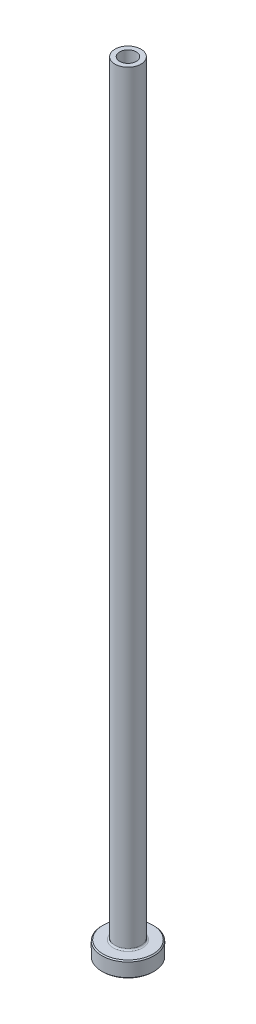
from build123d import *

# Parameters (mm, degrees)
FILLET1_R     = 0.3
CHAMFER1_SIZE = 0.2
CHAMFER3_SIZE = 0.5


with BuildPart() as part:
    # Sketch1 → Revolve1 (revolve)
    with BuildSketch(Plane.XY, mode=Mode.PRIVATE) as revolve1_sk:
        Polygon((-1.6, 150), (-2.5, 150), (-2.5, 3), (-5, 3), (-5, 0), (-1.85, 0), (-1.85, 93), (-1.6, 105), align=None)
    revolve(revolve1_sk.sketch.rotate(Axis((0, 92.187680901, 0), (0, -1, 0)), 270), axis=Axis((0, 92.187680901, 0), (0, -1, 0)))

    # Fillet1
    fillet1_edges = [part.edges().sort_by_distance(p)[0] for p in [
        (0, 3, -2.5),
    ]]
    fillet(fillet1_edges, radius=FILLET1_R)

    # Chamfer1
    chamfer1_edges = [part.edges().sort_by_distance(p)[0] for p in [
        (0, 0, -5),
        (0, 3, -5),
    ]]
    chamfer(chamfer1_edges, length=CHAMFER1_SIZE)

    # Chamfer3
    chamfer3_edges = [part.edges().sort_by_distance(p)[0] for p in [
        (0, 0, -1.85),
    ]]
    chamfer(chamfer3_edges, length=CHAMFER3_SIZE)


solid = part.part
